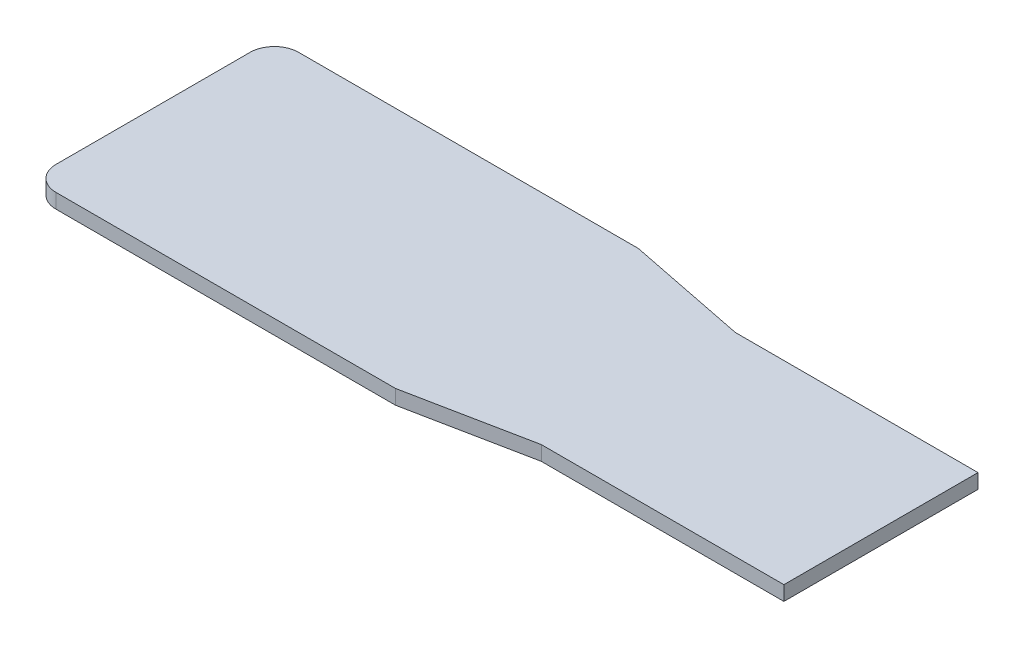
ISO-10303-21;
HEADER;
FILE_DESCRIPTION(('STEP AP214'),'2;1');
FILE_NAME('part.step','',(''),(''),'','','');
FILE_SCHEMA(('AUTOMOTIVE_DESIGN { 1 0 10303 214 1 1 1 1 }'));
ENDSEC;
DATA;
#1=APPLICATION_CONTEXT('core data for automotive mechanical design processes');
#2=APPLICATION_PROTOCOL_DEFINITION('international standard','automotive_design',2000,#1);
#3=PRODUCT_CONTEXT('',#1,'mechanical');
#4=PRODUCT('Part','Part','',(#3));
#5=PRODUCT_RELATED_PRODUCT_CATEGORY('part','',(#4));
#6=PRODUCT_DEFINITION_FORMATION('','',#4);
#7=PRODUCT_DEFINITION_CONTEXT('part definition',#1,'design');
#8=PRODUCT_DEFINITION('design','',#6,#7);
#9=PRODUCT_DEFINITION_SHAPE('','',#8);
#10=(LENGTH_UNIT() NAMED_UNIT(*) SI_UNIT(.MILLI.,.METRE.));
#11=(NAMED_UNIT(*) PLANE_ANGLE_UNIT() SI_UNIT($,.RADIAN.));
#12=(NAMED_UNIT(*) SI_UNIT($,.STERADIAN.) SOLID_ANGLE_UNIT());
#13=UNCERTAINTY_MEASURE_WITH_UNIT(LENGTH_MEASURE(1.E-05),#10,'distance_accuracy_value','');
#14=(GEOMETRIC_REPRESENTATION_CONTEXT(3) GLOBAL_UNCERTAINTY_ASSIGNED_CONTEXT((#13)) GLOBAL_UNIT_ASSIGNED_CONTEXT((#10,
#11,#12)) REPRESENTATION_CONTEXT('',''));
#15=CARTESIAN_POINT('',(0.,0.,0.));
#16=DIRECTION('',(0.,0.,1.));
#17=DIRECTION('',(1.,0.,0.));
#18=AXIS2_PLACEMENT_3D('',#15,#16,#17);
#19=CARTESIAN_POINT('',(25.4,0.762,5.08));
#20=DIRECTION('',(-0.196116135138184,0.,-0.98058067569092));
#21=DIRECTION('',(-0.98058067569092,0.,0.196116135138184));
#22=AXIS2_PLACEMENT_3D('',#19,#20,#21);
#23=PLANE('',#22);
#24=DIRECTION('',(0.98058067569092,0.,-0.196116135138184));
#25=VECTOR('',#24,1.);
#26=CARTESIAN_POINT('',(25.4,0.,5.08));
#27=LINE('',#26,#25);
#28=CARTESIAN_POINT('',(19.05,0.,6.35));
#29=VERTEX_POINT('',#28);
#30=CARTESIAN_POINT('',(25.4,0.,5.08));
#31=VERTEX_POINT('',#30);
#32=EDGE_CURVE('E160',#29,#31,#27,.T.);
#33=ORIENTED_EDGE('',*,*,#32,.T.);
#34=DIRECTION('',(0.,-1.,0.));
#35=VECTOR('',#34,1.);
#36=CARTESIAN_POINT('',(25.4,0.762,5.08));
#37=LINE('',#36,#35);
#38=CARTESIAN_POINT('',(25.4,0.762,5.08));
#39=VERTEX_POINT('',#38);
#40=EDGE_CURVE('E11',#39,#31,#37,.T.);
#41=ORIENTED_EDGE('',*,*,#40,.F.);
#42=DIRECTION('',(0.98058067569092,0.,-0.196116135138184));
#43=VECTOR('',#42,1.);
#44=CARTESIAN_POINT('',(25.4,0.762,5.08));
#45=LINE('',#44,#43);
#46=CARTESIAN_POINT('',(19.05,0.762,6.35));
#47=VERTEX_POINT('',#46);
#48=EDGE_CURVE('E188',#47,#39,#45,.T.);
#49=ORIENTED_EDGE('',*,*,#48,.F.);
#50=DIRECTION('',(0.,-1.,0.));
#51=VECTOR('',#50,1.);
#52=CARTESIAN_POINT('',(19.05,0.762,6.35));
#53=LINE('',#52,#51);
#54=EDGE_CURVE('E156',#47,#29,#53,.T.);
#55=ORIENTED_EDGE('',*,*,#54,.T.);
#56=EDGE_LOOP('',(#33,#41,#49,#55));
#57=FACE_BOUND('',#56,.T.);
#58=ADVANCED_FACE('F47',(#57),#23,.F.);
#59=CARTESIAN_POINT('',(38.1,0.762,5.08));
#60=DIRECTION('',(0.,0.,-1.));
#61=DIRECTION('',(-1.,0.,0.));
#62=AXIS2_PLACEMENT_3D('',#59,#60,#61);
#63=PLANE('',#62);
#64=DIRECTION('',(1.,0.,0.));
#65=VECTOR('',#64,1.);
#66=CARTESIAN_POINT('',(38.1,0.,5.08));
#67=LINE('',#66,#65);
#68=CARTESIAN_POINT('',(38.1,0.,5.08));
#69=VERTEX_POINT('',#68);
#70=EDGE_CURVE('E164',#31,#69,#67,.T.);
#71=ORIENTED_EDGE('',*,*,#70,.T.);
#72=DIRECTION('',(0.,-1.,0.));
#73=VECTOR('',#72,1.);
#74=CARTESIAN_POINT('',(38.1,0.762,5.08));
#75=LINE('',#74,#73);
#76=CARTESIAN_POINT('',(38.1,0.762,5.08));
#77=VERTEX_POINT('',#76);
#78=EDGE_CURVE('E56',#77,#69,#75,.T.);
#79=ORIENTED_EDGE('',*,*,#78,.F.);
#80=DIRECTION('',(1.,0.,0.));
#81=VECTOR('',#80,1.);
#82=CARTESIAN_POINT('',(38.1,0.762,5.08));
#83=LINE('',#82,#81);
#84=EDGE_CURVE('E113',#39,#77,#83,.T.);
#85=ORIENTED_EDGE('',*,*,#84,.F.);
#86=ORIENTED_EDGE('',*,*,#40,.T.);
#87=EDGE_LOOP('',(#71,#79,#85,#86));
#88=FACE_BOUND('',#87,.T.);
#89=ADVANCED_FACE('F252',(#88),#63,.F.);
#90=CARTESIAN_POINT('',(38.1,0.762,-5.08));
#91=DIRECTION('',(-1.,0.,0.));
#92=DIRECTION('',(0.,0.,1.));
#93=AXIS2_PLACEMENT_3D('',#90,#91,#92);
#94=PLANE('',#93);
#95=DIRECTION('',(0.,0.,-1.));
#96=VECTOR('',#95,1.);
#97=CARTESIAN_POINT('',(38.1,0.,-5.08));
#98=LINE('',#97,#96);
#99=CARTESIAN_POINT('',(38.1,0.,-5.08));
#100=VERTEX_POINT('',#99);
#101=EDGE_CURVE('E167',#69,#100,#98,.T.);
#102=ORIENTED_EDGE('',*,*,#101,.T.);
#103=DIRECTION('',(0.,-1.,0.));
#104=VECTOR('',#103,1.);
#105=CARTESIAN_POINT('',(38.1,0.762,-5.08));
#106=LINE('',#105,#104);
#107=CARTESIAN_POINT('',(38.1,0.762,-5.08));
#108=VERTEX_POINT('',#107);
#109=EDGE_CURVE('E207',#108,#100,#106,.T.);
#110=ORIENTED_EDGE('',*,*,#109,.F.);
#111=DIRECTION('',(0.,0.,-1.));
#112=VECTOR('',#111,1.);
#113=CARTESIAN_POINT('',(38.1,0.762,-5.08));
#114=LINE('',#113,#112);
#115=EDGE_CURVE('E217',#77,#108,#114,.T.);
#116=ORIENTED_EDGE('',*,*,#115,.F.);
#117=ORIENTED_EDGE('',*,*,#78,.T.);
#118=EDGE_LOOP('',(#102,#110,#116,#117));
#119=FACE_BOUND('',#118,.T.);
#120=ADVANCED_FACE('F215',(#119),#94,.F.);
#121=CARTESIAN_POINT('',(25.4,0.762,-5.08));
#122=DIRECTION('',(0.,0.,1.));
#123=DIRECTION('',(1.,0.,0.));
#124=AXIS2_PLACEMENT_3D('',#121,#122,#123);
#125=PLANE('',#124);
#126=DIRECTION('',(-1.,0.,0.));
#127=VECTOR('',#126,1.);
#128=CARTESIAN_POINT('',(25.4,0.,-5.08));
#129=LINE('',#128,#127);
#130=CARTESIAN_POINT('',(25.4,0.,-5.08));
#131=VERTEX_POINT('',#130);
#132=EDGE_CURVE('E170',#100,#131,#129,.T.);
#133=ORIENTED_EDGE('',*,*,#132,.T.);
#134=DIRECTION('',(0.,-1.,0.));
#135=VECTOR('',#134,1.);
#136=CARTESIAN_POINT('',(25.4,0.762,-5.08));
#137=LINE('',#136,#135);
#138=CARTESIAN_POINT('',(25.4,0.762,-5.08));
#139=VERTEX_POINT('',#138);
#140=EDGE_CURVE('E203',#139,#131,#137,.T.);
#141=ORIENTED_EDGE('',*,*,#140,.F.);
#142=DIRECTION('',(-1.,0.,0.));
#143=VECTOR('',#142,1.);
#144=CARTESIAN_POINT('',(25.4,0.762,-5.08));
#145=LINE('',#144,#143);
#146=EDGE_CURVE('E236',#108,#139,#145,.T.);
#147=ORIENTED_EDGE('',*,*,#146,.F.);
#148=ORIENTED_EDGE('',*,*,#109,.T.);
#149=EDGE_LOOP('',(#133,#141,#147,#148));
#150=FACE_BOUND('',#149,.T.);
#151=ADVANCED_FACE('F226',(#150),#125,.F.);
#152=CARTESIAN_POINT('',(19.05,0.762,-6.35000000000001));
#153=DIRECTION('',(-0.196116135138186,0.,0.98058067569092));
#154=DIRECTION('',(0.98058067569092,0.,0.196116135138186));
#155=AXIS2_PLACEMENT_3D('',#152,#153,#154);
#156=PLANE('',#155);
#157=DIRECTION('',(-0.98058067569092,0.,-0.196116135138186));
#158=VECTOR('',#157,1.);
#159=CARTESIAN_POINT('',(19.05,0.,-6.35000000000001));
#160=LINE('',#159,#158);
#161=CARTESIAN_POINT('',(19.05,0.,-6.35000000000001));
#162=VERTEX_POINT('',#161);
#163=EDGE_CURVE('E173',#131,#162,#160,.T.);
#164=ORIENTED_EDGE('',*,*,#163,.T.);
#165=DIRECTION('',(0.,-1.,0.));
#166=VECTOR('',#165,1.);
#167=CARTESIAN_POINT('',(19.05,0.762,-6.35000000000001));
#168=LINE('',#167,#166);
#169=CARTESIAN_POINT('',(19.05,0.762,-6.35000000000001));
#170=VERTEX_POINT('',#169);
#171=EDGE_CURVE('E199',#170,#162,#168,.T.);
#172=ORIENTED_EDGE('',*,*,#171,.F.);
#173=DIRECTION('',(-0.98058067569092,0.,-0.196116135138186));
#174=VECTOR('',#173,1.);
#175=CARTESIAN_POINT('',(19.05,0.762,-6.35000000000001));
#176=LINE('',#175,#174);
#177=EDGE_CURVE('E232',#139,#170,#176,.T.);
#178=ORIENTED_EDGE('',*,*,#177,.F.);
#179=ORIENTED_EDGE('',*,*,#140,.T.);
#180=EDGE_LOOP('',(#164,#172,#178,#179));
#181=FACE_BOUND('',#180,.T.);
#182=ADVANCED_FACE('F230',(#181),#156,.F.);
#183=CARTESIAN_POINT('',(1.27,0.762,-6.35));
#184=DIRECTION('',(0.,0.,1.));
#185=DIRECTION('',(1.,0.,0.));
#186=AXIS2_PLACEMENT_3D('',#183,#184,#185);
#187=PLANE('',#186);
#188=DIRECTION('',(-1.,0.,0.));
#189=VECTOR('',#188,1.);
#190=CARTESIAN_POINT('',(1.27,0.,-6.35));
#191=LINE('',#190,#189);
#192=CARTESIAN_POINT('',(1.27,0.,-6.35));
#193=VERTEX_POINT('',#192);
#194=EDGE_CURVE('E176',#162,#193,#191,.T.);
#195=ORIENTED_EDGE('',*,*,#194,.T.);
#196=DIRECTION('',(0.,-1.,0.));
#197=VECTOR('',#196,1.);
#198=CARTESIAN_POINT('',(1.27,0.762,-6.35));
#199=LINE('',#198,#197);
#200=CARTESIAN_POINT('',(1.27,0.762,-6.35));
#201=VERTEX_POINT('',#200);
#202=EDGE_CURVE('E195',#201,#193,#199,.T.);
#203=ORIENTED_EDGE('',*,*,#202,.F.);
#204=DIRECTION('',(-1.,0.,0.));
#205=VECTOR('',#204,1.);
#206=CARTESIAN_POINT('',(1.27,0.762,-6.35));
#207=LINE('',#206,#205);
#208=EDGE_CURVE('E235',#170,#201,#207,.T.);
#209=ORIENTED_EDGE('',*,*,#208,.F.);
#210=ORIENTED_EDGE('',*,*,#171,.T.);
#211=EDGE_LOOP('',(#195,#203,#209,#210));
#212=FACE_BOUND('',#211,.T.);
#213=ADVANCED_FACE('F264',(#212),#187,.F.);
#214=CARTESIAN_POINT('',(1.27,0.762,-5.08));
#215=DIRECTION('',(0.,-1.,0.));
#216=DIRECTION('',(0.,0.,-1.));
#217=AXIS2_PLACEMENT_3D('',#214,#215,#216);
#218=CYLINDRICAL_SURFACE('',#217,1.27);
#219=CARTESIAN_POINT('',(1.27,0.,-5.08));
#220=DIRECTION('',(0.,1.,0.));
#221=DIRECTION('',(0.,0.,1.));
#222=AXIS2_PLACEMENT_3D('',#219,#220,#221);
#223=CIRCLE('',#222,1.27);
#224=CARTESIAN_POINT('',(0.,0.,-5.07999999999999));
#225=VERTEX_POINT('',#224);
#226=EDGE_CURVE('E179',#193,#225,#223,.T.);
#227=ORIENTED_EDGE('',*,*,#226,.T.);
#228=DIRECTION('',(0.,-1.,0.));
#229=VECTOR('',#228,1.);
#230=CARTESIAN_POINT('',(0.,0.762,-5.07999999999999));
#231=LINE('',#230,#229);
#232=CARTESIAN_POINT('',(0.,0.762,-5.07999999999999));
#233=VERTEX_POINT('',#232);
#234=EDGE_CURVE('E149',#233,#225,#231,.T.);
#235=ORIENTED_EDGE('',*,*,#234,.F.);
#236=CARTESIAN_POINT('',(1.27,0.762,-5.08));
#237=DIRECTION('',(0.,1.,0.));
#238=DIRECTION('',(0.,0.,1.));
#239=AXIS2_PLACEMENT_3D('',#236,#237,#238);
#240=CIRCLE('',#239,1.27);
#241=EDGE_CURVE('E138',#201,#233,#240,.T.);
#242=ORIENTED_EDGE('',*,*,#241,.F.);
#243=ORIENTED_EDGE('',*,*,#202,.T.);
#244=EDGE_LOOP('',(#227,#235,#242,#243));
#245=FACE_BOUND('',#244,.T.);
#246=ADVANCED_FACE('F267',(#245),#218,.T.);
#247=CARTESIAN_POINT('',(0.,0.762,-5.07999999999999));
#248=DIRECTION('',(1.,0.,0.));
#249=DIRECTION('',(0.,0.,-1.));
#250=AXIS2_PLACEMENT_3D('',#247,#248,#249);
#251=PLANE('',#250);
#252=DIRECTION('',(0.,0.,1.));
#253=VECTOR('',#252,1.);
#254=CARTESIAN_POINT('',(0.,0.,-5.07999999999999));
#255=LINE('',#254,#253);
#256=CARTESIAN_POINT('',(0.,0.,5.07999999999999));
#257=VERTEX_POINT('',#256);
#258=EDGE_CURVE('E147',#225,#257,#255,.T.);
#259=ORIENTED_EDGE('',*,*,#258,.T.);
#260=DIRECTION('',(0.,-1.,0.));
#261=VECTOR('',#260,1.);
#262=CARTESIAN_POINT('',(0.,0.762,5.07999999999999));
#263=LINE('',#262,#261);
#264=CARTESIAN_POINT('',(0.,0.762,5.07999999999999));
#265=VERTEX_POINT('',#264);
#266=EDGE_CURVE('E144',#265,#257,#263,.T.);
#267=ORIENTED_EDGE('',*,*,#266,.F.);
#268=DIRECTION('',(0.,0.,1.));
#269=VECTOR('',#268,1.);
#270=CARTESIAN_POINT('',(0.,0.762,-5.07999999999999));
#271=LINE('',#270,#269);
#272=EDGE_CURVE('E132',#233,#265,#271,.T.);
#273=ORIENTED_EDGE('',*,*,#272,.F.);
#274=ORIENTED_EDGE('',*,*,#234,.T.);
#275=EDGE_LOOP('',(#259,#267,#273,#274));
#276=FACE_BOUND('',#275,.T.);
#277=ADVANCED_FACE('F145',(#276),#251,.F.);
#278=CARTESIAN_POINT('',(1.27,0.762,5.08));
#279=DIRECTION('',(0.,-1.,0.));
#280=DIRECTION('',(0.,0.,-1.));
#281=AXIS2_PLACEMENT_3D('',#278,#279,#280);
#282=CYLINDRICAL_SURFACE('',#281,1.27);
#283=CARTESIAN_POINT('',(1.27,0.,5.08));
#284=DIRECTION('',(0.,1.,0.));
#285=DIRECTION('',(0.,0.,1.));
#286=AXIS2_PLACEMENT_3D('',#283,#284,#285);
#287=CIRCLE('',#286,1.27);
#288=CARTESIAN_POINT('',(1.27000000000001,0.,6.35));
#289=VERTEX_POINT('',#288);
#290=EDGE_CURVE('E99',#257,#289,#287,.T.);
#291=ORIENTED_EDGE('',*,*,#290,.T.);
#292=DIRECTION('',(0.,-1.,0.));
#293=VECTOR('',#292,1.);
#294=CARTESIAN_POINT('',(1.27000000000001,0.762,6.35));
#295=LINE('',#294,#293);
#296=CARTESIAN_POINT('',(1.27000000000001,0.762,6.35));
#297=VERTEX_POINT('',#296);
#298=EDGE_CURVE('E150',#297,#289,#295,.T.);
#299=ORIENTED_EDGE('',*,*,#298,.F.);
#300=CARTESIAN_POINT('',(1.27,0.762,5.08));
#301=DIRECTION('',(0.,1.,0.));
#302=DIRECTION('',(0.,0.,1.));
#303=AXIS2_PLACEMENT_3D('',#300,#301,#302);
#304=CIRCLE('',#303,1.27);
#305=EDGE_CURVE('E136',#265,#297,#304,.T.);
#306=ORIENTED_EDGE('',*,*,#305,.F.);
#307=ORIENTED_EDGE('',*,*,#266,.T.);
#308=EDGE_LOOP('',(#291,#299,#306,#307));
#309=FACE_BOUND('',#308,.T.);
#310=ADVANCED_FACE('F152',(#309),#282,.T.);
#311=CARTESIAN_POINT('',(1.27000000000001,0.762,6.35));
#312=DIRECTION('',(0.,0.,-1.));
#313=DIRECTION('',(-1.,0.,0.));
#314=AXIS2_PLACEMENT_3D('',#311,#312,#313);
#315=PLANE('',#314);
#316=DIRECTION('',(1.,0.,0.));
#317=VECTOR('',#316,1.);
#318=CARTESIAN_POINT('',(1.27000000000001,0.,6.35));
#319=LINE('',#318,#317);
#320=EDGE_CURVE('E105',#289,#29,#319,.T.);
#321=ORIENTED_EDGE('',*,*,#320,.T.);
#322=ORIENTED_EDGE('',*,*,#54,.F.);
#323=DIRECTION('',(1.,0.,0.));
#324=VECTOR('',#323,1.);
#325=CARTESIAN_POINT('',(1.27000000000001,0.762,6.35));
#326=LINE('',#325,#324);
#327=EDGE_CURVE('E64',#297,#47,#326,.T.);
#328=ORIENTED_EDGE('',*,*,#327,.F.);
#329=ORIENTED_EDGE('',*,*,#298,.T.);
#330=EDGE_LOOP('',(#321,#322,#328,#329));
#331=FACE_BOUND('',#330,.T.);
#332=ADVANCED_FACE('F276',(#331),#315,.F.);
#333=CARTESIAN_POINT('',(1.27,0.762,5.08));
#334=DIRECTION('',(0.,1.,0.));
#335=DIRECTION('',(0.,0.,1.));
#336=AXIS2_PLACEMENT_3D('',#333,#334,#335);
#337=PLANE('',#336);
#338=ORIENTED_EDGE('',*,*,#48,.T.);
#339=ORIENTED_EDGE('',*,*,#84,.T.);
#340=ORIENTED_EDGE('',*,*,#115,.T.);
#341=ORIENTED_EDGE('',*,*,#146,.T.);
#342=ORIENTED_EDGE('',*,*,#177,.T.);
#343=ORIENTED_EDGE('',*,*,#208,.T.);
#344=ORIENTED_EDGE('',*,*,#241,.T.);
#345=ORIENTED_EDGE('',*,*,#272,.T.);
#346=ORIENTED_EDGE('',*,*,#305,.T.);
#347=ORIENTED_EDGE('',*,*,#327,.T.);
#348=EDGE_LOOP('',(#338,#339,#340,#341,#342,#343,#344,#345,#346,#347));
#349=FACE_BOUND('',#348,.T.);
#350=ADVANCED_FACE('F134',(#349),#337,.T.);
#351=CARTESIAN_POINT('',(1.27,0.,5.08));
#352=DIRECTION('',(0.,1.,0.));
#353=DIRECTION('',(0.,0.,1.));
#354=AXIS2_PLACEMENT_3D('',#351,#352,#353);
#355=PLANE('',#354);
#356=ORIENTED_EDGE('',*,*,#32,.F.);
#357=ORIENTED_EDGE('',*,*,#320,.F.);
#358=ORIENTED_EDGE('',*,*,#290,.F.);
#359=ORIENTED_EDGE('',*,*,#258,.F.);
#360=ORIENTED_EDGE('',*,*,#226,.F.);
#361=ORIENTED_EDGE('',*,*,#194,.F.);
#362=ORIENTED_EDGE('',*,*,#163,.F.);
#363=ORIENTED_EDGE('',*,*,#132,.F.);
#364=ORIENTED_EDGE('',*,*,#101,.F.);
#365=ORIENTED_EDGE('',*,*,#70,.F.);
#366=EDGE_LOOP('',(#356,#357,#358,#359,#360,#361,#362,#363,#364,#365));
#367=FACE_BOUND('',#366,.T.);
#368=ADVANCED_FACE('F221',(#367),#355,.F.);
#369=CLOSED_SHELL('',(#58,#89,#120,#151,#182,#213,#246,#277,#310,#332,#350,#368));
#370=MANIFOLD_SOLID_BREP('B2',#369);
#371=ADVANCED_BREP_SHAPE_REPRESENTATION('',(#18,#370),#14);
#372=SHAPE_DEFINITION_REPRESENTATION(#9,#371);
ENDSEC;
END-ISO-10303-21;
